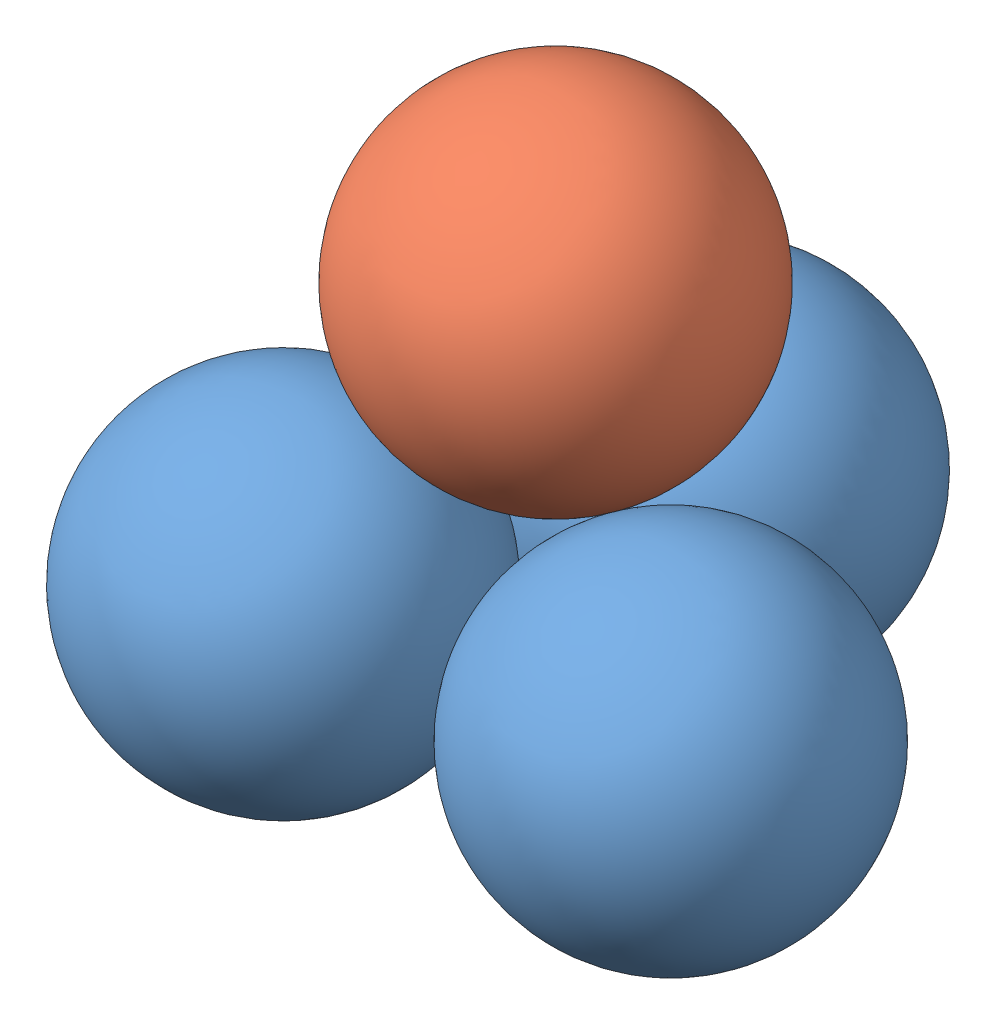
SolidWorks assembly Pom Stack Green.SLDASM, configuration Default (file format 16000). Lengths in mm.
Overall size (78.53 76.73 79.9).
5 component instances, 2 part files, 6 mates.
Components (placement in the parent):
- Pom Stack Bottom - Green-1: Pom Stack Bottom - Green.SLDASM [Default] at origin size (78.53 53.14 79.9)
  - pom-green-5: pom-green.SLDPRT [Default] at (-16.8715 0 14.1147) x (0.166199 0 0.986092) z (-0.986092 0 0.166199) size (38.1 38.1 38.1)
  - pom-green-6: pom-green.SLDPRT [Default] at (20.6594 0 7.5538) size (38.1 38.1 38.1)
  - pom-green-7: pom-green.SLDPRT [Default] at (-12.0098 1.8663 -21.8226) x (0.888303 -0.42655 0.170215) z (-0.15699 0.066277 0.985374) size (38.1 38.1 38.1)
- pom-red-2: pom-red.SLDPRT [Default] at (0 31.1085 0) size (38.1 38.1 38.1)
Mates (geometry in assembly coordinates):
- Coincident1: coincident aligned: plane of Pom Stack Bottom - Green-1 through (0 0 0) normal (0 1 0)
- Coincident2: coincident aligned: plane of Pom Stack Bottom - Green-1 through (0 0 0) normal (0 0 1)
- Coincident3: coincident aligned: plane of Pom Stack Bottom - Green-1 through (0 0 0) normal (1 0 0)
- Tangent1: tangent anti-aligned: sphere of Pom Stack Bottom - Green-1/pom-green-7; sphere of pom-red-2
- Tangent2: tangent anti-aligned: sphere of Pom Stack Bottom - Green-1/pom-green-6; sphere of pom-red-2
- Tangent3: tangent anti-aligned: sphere of Pom Stack Bottom - Green-1/pom-green-5; sphere of pom-red-2
